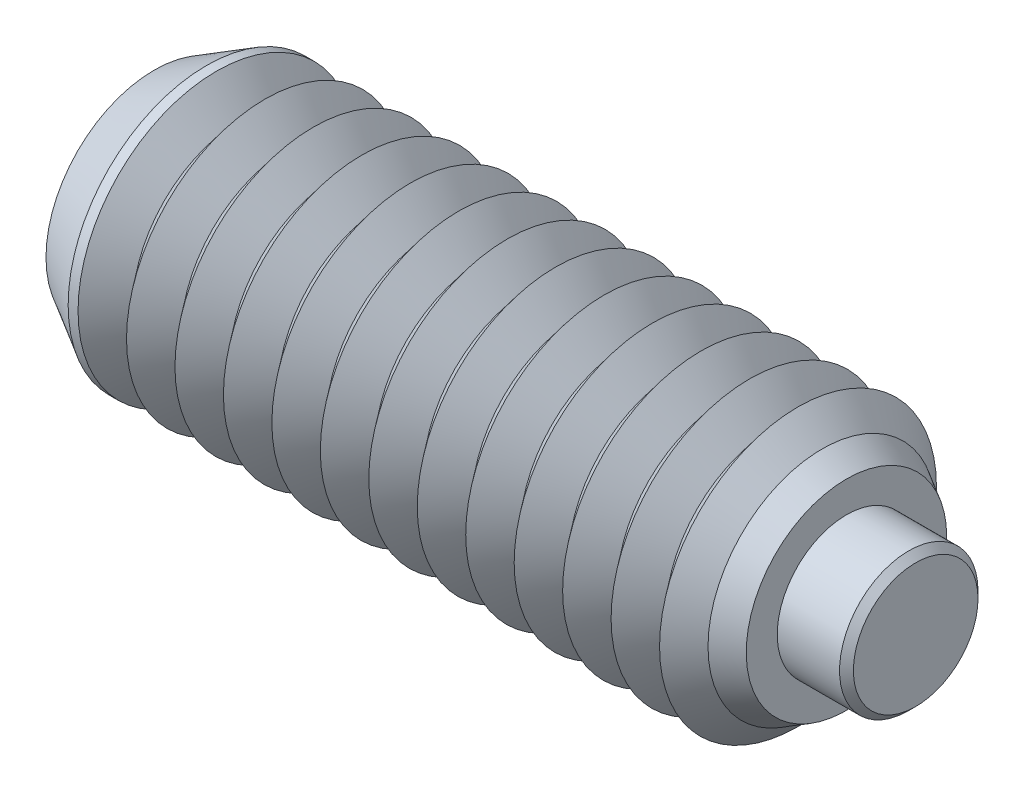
ISO-10303-21;
HEADER;
FILE_DESCRIPTION(('STEP AP214'),'2;1');
FILE_NAME('part.step','',(''),(''),'','','');
FILE_SCHEMA(('AUTOMOTIVE_DESIGN { 1 0 10303 214 1 1 1 1 }'));
ENDSEC;
DATA;
#1=APPLICATION_CONTEXT('core data for automotive mechanical design processes');
#2=APPLICATION_PROTOCOL_DEFINITION('international standard','automotive_design',2000,#1);
#3=PRODUCT_CONTEXT('',#1,'mechanical');
#4=PRODUCT('Part','Part','',(#3));
#5=PRODUCT_RELATED_PRODUCT_CATEGORY('part','',(#4));
#6=PRODUCT_DEFINITION_FORMATION('','',#4);
#7=PRODUCT_DEFINITION_CONTEXT('part definition',#1,'design');
#8=PRODUCT_DEFINITION('design','',#6,#7);
#9=PRODUCT_DEFINITION_SHAPE('','',#8);
#10=(LENGTH_UNIT() NAMED_UNIT(*) SI_UNIT(.MILLI.,.METRE.));
#11=(NAMED_UNIT(*) PLANE_ANGLE_UNIT() SI_UNIT($,.RADIAN.));
#12=(NAMED_UNIT(*) SI_UNIT($,.STERADIAN.) SOLID_ANGLE_UNIT());
#13=UNCERTAINTY_MEASURE_WITH_UNIT(LENGTH_MEASURE(1.E-05),#10,'distance_accuracy_value','');
#14=(GEOMETRIC_REPRESENTATION_CONTEXT(3) GLOBAL_UNCERTAINTY_ASSIGNED_CONTEXT((#13)) GLOBAL_UNIT_ASSIGNED_CONTEXT((#10,
#11,#12)) REPRESENTATION_CONTEXT('',''));
#15=CARTESIAN_POINT('',(0.,0.,0.));
#16=DIRECTION('',(0.,0.,1.));
#17=DIRECTION('',(1.,0.,0.));
#18=AXIS2_PLACEMENT_3D('',#15,#16,#17);
#19=CARTESIAN_POINT('',(1.35,0.,0.));
#20=DIRECTION('',(-1.,0.,0.));
#21=DIRECTION('',(0.,0.,1.));
#22=AXIS2_PLACEMENT_3D('',#19,#20,#21);
#23=CYLINDRICAL_SURFACE('',#22,1.);
#24=CARTESIAN_POINT('',(1.25,0.,0.));
#25=DIRECTION('',(1.,0.,0.));
#26=DIRECTION('',(0.,0.,-1.));
#27=AXIS2_PLACEMENT_3D('',#24,#25,#26);
#28=CIRCLE('',#27,1.);
#29=CARTESIAN_POINT('',(1.25,0.,-1.));
#30=VERTEX_POINT('',#29);
#31=EDGE_CURVE('P0_E10',#30,#30,#28,.F.);
#32=ORIENTED_EDGE('',*,*,#31,.T.);
#33=EDGE_LOOP('',(#32));
#34=FACE_BOUND('',#33,.T.);
#35=CARTESIAN_POINT('',(-0.65,0.,0.));
#36=DIRECTION('',(1.,0.,0.));
#37=DIRECTION('',(0.,0.,-1.));
#38=AXIS2_PLACEMENT_3D('',#35,#36,#37);
#39=CIRCLE('',#38,1.);
#40=CARTESIAN_POINT('',(-0.65,0.,-1.));
#41=VERTEX_POINT('',#40);
#42=EDGE_CURVE('P0_E25',#41,#41,#39,.T.);
#43=ORIENTED_EDGE('',*,*,#42,.T.);
#44=EDGE_LOOP('',(#43));
#45=FACE_BOUND('',#44,.T.);
#46=ADVANCED_FACE('P0_F14',(#34,#45),#23,.T.);
#47=CARTESIAN_POINT('',(1.35,0.,0.));
#48=DIRECTION('',(1.,0.,0.));
#49=DIRECTION('',(0.,0.,-1.));
#50=AXIS2_PLACEMENT_3D('',#47,#48,#49);
#51=PLANE('',#50);
#52=CARTESIAN_POINT('',(1.35,0.,0.));
#53=DIRECTION('',(1.,0.,0.));
#54=DIRECTION('',(0.,0.,-1.));
#55=AXIS2_PLACEMENT_3D('',#52,#53,#54);
#56=CIRCLE('',#55,0.899999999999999);
#57=CARTESIAN_POINT('',(1.35,0.,-0.899999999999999));
#58=VERTEX_POINT('',#57);
#59=EDGE_CURVE('P0_E21',#58,#58,#56,.T.);
#60=ORIENTED_EDGE('',*,*,#59,.T.);
#61=EDGE_LOOP('',(#60));
#62=FACE_BOUND('',#61,.T.);
#63=ADVANCED_FACE('P0_F35',(#62),#51,.T.);
#64=CARTESIAN_POINT('',(-0.65,0.,0.));
#65=DIRECTION('',(1.,0.,0.));
#66=DIRECTION('',(0.,0.,-1.));
#67=AXIS2_PLACEMENT_3D('',#64,#65,#66);
#68=PLANE('',#67);
#69=ORIENTED_EDGE('',*,*,#42,.F.);
#70=EDGE_LOOP('',(#69));
#71=FACE_BOUND('',#70,.T.);
#72=ADVANCED_FACE('P0_F33',(#71),#68,.F.);
#73=CARTESIAN_POINT('',(1.35,0.,0.));
#74=DIRECTION('',(-1.,0.,0.));
#75=DIRECTION('',(0.,0.,1.));
#76=AXIS2_PLACEMENT_3D('',#73,#74,#75);
#77=CONICAL_SURFACE('',#76,0.899999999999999,0.785398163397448);
#78=ORIENTED_EDGE('',*,*,#31,.F.);
#79=EDGE_LOOP('',(#78));
#80=FACE_BOUND('',#79,.T.);
#81=ORIENTED_EDGE('',*,*,#59,.F.);
#82=EDGE_LOOP('',(#81));
#83=FACE_BOUND('',#82,.T.);
#84=ADVANCED_FACE('P0_F16',(#80,#83),#77,.T.);
#85=CLOSED_SHELL('',(#46,#63,#72,#84));
#86=MANIFOLD_SOLID_BREP('P0_B1',#85);
#87=CARTESIAN_POINT('',(-9.65,0.,0.));
#88=DIRECTION('',(1.,0.,0.));
#89=DIRECTION('',(0.,0.,-1.));
#90=AXIS2_PLACEMENT_3D('',#87,#88,#89);
#91=CYLINDRICAL_SURFACE('',#90,2.);
#92=CARTESIAN_POINT('',(-8.75,0.,0.));
#93=DIRECTION('',(1.,0.,0.));
#94=DIRECTION('',(0.,0.,-1.));
#95=AXIS2_PLACEMENT_3D('',#92,#93,#94);
#96=CIRCLE('',#95,2.);
#97=CARTESIAN_POINT('',(-8.75,0.,-2.));
#98=VERTEX_POINT('',#97);
#99=EDGE_CURVE('P1_E226',#98,#98,#96,.T.);
#100=ORIENTED_EDGE('',*,*,#99,.F.);
#101=EDGE_LOOP('',(#100));
#102=FACE_BOUND('',#101,.T.);
#103=CARTESIAN_POINT('',(-8.89283423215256,0.,0.));
#104=DIRECTION('',(1.,0.,0.));
#105=DIRECTION('',(0.,0.,-1.));
#106=AXIS2_PLACEMENT_3D('',#103,#104,#105);
#107=CIRCLE('',#106,2.);
#108=CARTESIAN_POINT('',(-8.89283423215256,0.,-2.));
#109=VERTEX_POINT('',#108);
#110=EDGE_CURVE('P1_E229',#109,#109,#107,.T.);
#111=ORIENTED_EDGE('',*,*,#110,.T.);
#112=EDGE_LOOP('',(#111));
#113=FACE_BOUND('',#112,.T.);
#114=ADVANCED_FACE('P1_F15',(#102,#113),#91,.T.);
#115=CARTESIAN_POINT('',(-0.700000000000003,0.,0.));
#116=DIRECTION('',(1.,0.,0.));
#117=DIRECTION('',(0.,0.,-1.));
#118=AXIS2_PLACEMENT_3D('',#115,#116,#117);
#119=CONICAL_SURFACE('',#118,1.56285014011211,0.895664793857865);
#120=CARTESIAN_POINT('',(-0.350000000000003,0.,0.));
#121=DIRECTION('',(1.,0.,0.));
#122=DIRECTION('',(0.,0.,-1.));
#123=AXIS2_PLACEMENT_3D('',#120,#121,#122);
#124=CIRCLE('',#123,2.);
#125=CARTESIAN_POINT('',(-0.350000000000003,0.,-2.));
#126=VERTEX_POINT('',#125);
#127=EDGE_CURVE('P1_E284',#126,#126,#124,.T.);
#128=ORIENTED_EDGE('',*,*,#127,.F.);
#129=EDGE_LOOP('',(#128));
#130=FACE_BOUND('',#129,.T.);
#131=CARTESIAN_POINT('',(-0.700000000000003,0.,0.));
#132=DIRECTION('',(1.,0.,0.));
#133=DIRECTION('',(0.,0.,-1.));
#134=AXIS2_PLACEMENT_3D('',#131,#132,#133);
#135=CIRCLE('',#134,1.56285014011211);
#136=CARTESIAN_POINT('',(-0.700000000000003,0.,-1.56285014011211));
#137=VERTEX_POINT('',#136);
#138=EDGE_CURVE('P1_E289',#137,#137,#135,.T.);
#139=ORIENTED_EDGE('',*,*,#138,.T.);
#140=EDGE_LOOP('',(#139));
#141=FACE_BOUND('',#140,.T.);
#142=ADVANCED_FACE('P1_F214',(#130,#141),#119,.T.);
#143=CARTESIAN_POINT('',(-1.05,0.,0.));
#144=DIRECTION('',(-1.,0.,0.));
#145=DIRECTION('',(0.,0.,1.));
#146=AXIS2_PLACEMENT_3D('',#143,#144,#145);
#147=CONICAL_SURFACE('',#146,2.,0.895664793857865);
#148=ORIENTED_EDGE('',*,*,#138,.F.);
#149=EDGE_LOOP('',(#148));
#150=FACE_BOUND('',#149,.T.);
#151=CARTESIAN_POINT('',(-1.05,0.,0.));
#152=DIRECTION('',(1.,0.,0.));
#153=DIRECTION('',(0.,0.,-1.));
#154=AXIS2_PLACEMENT_3D('',#151,#152,#153);
#155=CIRCLE('',#154,2.);
#156=CARTESIAN_POINT('',(-1.05,0.,-2.));
#157=VERTEX_POINT('',#156);
#158=EDGE_CURVE('P1_E292',#157,#157,#155,.T.);
#159=ORIENTED_EDGE('',*,*,#158,.T.);
#160=EDGE_LOOP('',(#159));
#161=FACE_BOUND('',#160,.T.);
#162=ADVANCED_FACE('P1_F220',(#150,#161),#147,.T.);
#163=CARTESIAN_POINT('',(-0.65,0.,0.));
#164=DIRECTION('',(1.,0.,0.));
#165=DIRECTION('',(0.,1.,0.));
#166=AXIS2_PLACEMENT_3D('',#163,#164,#165);
#167=PLANE('',#166);
#168=CARTESIAN_POINT('',(-0.65,0.,0.));
#169=DIRECTION('',(1.,0.,0.));
#170=DIRECTION('',(0.,1.,0.));
#171=AXIS2_PLACEMENT_3D('',#168,#169,#170);
#172=CIRCLE('',#171,1.);
#173=CARTESIAN_POINT('',(-0.65,1.,0.));
#174=VERTEX_POINT('',#173);
#175=EDGE_CURVE('P1_E279',#174,#174,#172,.T.);
#176=ORIENTED_EDGE('',*,*,#175,.T.);
#177=EDGE_LOOP('',(#176));
#178=FACE_BOUND('',#177,.T.);
#179=ADVANCED_FACE('P1_F451',(#178),#167,.T.);
#180=CARTESIAN_POINT('',(-0.65,0.,0.));
#181=DIRECTION('',(1.,0.,0.));
#182=DIRECTION('',(0.,1.,0.));
#183=AXIS2_PLACEMENT_3D('',#180,#181,#182);
#184=CYLINDRICAL_SURFACE('',#183,1.);
#185=ORIENTED_EDGE('',*,*,#175,.F.);
#186=EDGE_LOOP('',(#185));
#187=FACE_BOUND('',#186,.T.);
#188=CARTESIAN_POINT('',(0.35,0.,0.));
#189=DIRECTION('',(1.,0.,0.));
#190=DIRECTION('',(0.,1.,0.));
#191=AXIS2_PLACEMENT_3D('',#188,#189,#190);
#192=CIRCLE('',#191,1.);
#193=CARTESIAN_POINT('',(0.35,1.,0.));
#194=VERTEX_POINT('',#193);
#195=EDGE_CURVE('P1_E281',#194,#194,#192,.T.);
#196=ORIENTED_EDGE('',*,*,#195,.T.);
#197=EDGE_LOOP('',(#196));
#198=FACE_BOUND('',#197,.T.);
#199=ADVANCED_FACE('P1_F210',(#187,#198),#184,.F.);
#200=CARTESIAN_POINT('',(0.35,1.44792740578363,0.));
#201=DIRECTION('',(1.,0.,0.));
#202=DIRECTION('',(0.,1.,0.));
#203=AXIS2_PLACEMENT_3D('',#200,#201,#202);
#204=PLANE('',#203);
#205=ORIENTED_EDGE('',*,*,#195,.F.);
#206=EDGE_LOOP('',(#205));
#207=FACE_BOUND('',#206,.T.);
#208=CARTESIAN_POINT('',(0.35,0.,0.));
#209=DIRECTION('',(1.,0.,0.));
#210=DIRECTION('',(0.,1.,0.));
#211=AXIS2_PLACEMENT_3D('',#208,#209,#210);
#212=CIRCLE('',#211,1.44792740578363);
#213=CARTESIAN_POINT('',(0.35,1.44792740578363,0.));
#214=VERTEX_POINT('',#213);
#215=EDGE_CURVE('P1_E121',#214,#214,#212,.T.);
#216=ORIENTED_EDGE('',*,*,#215,.T.);
#217=EDGE_LOOP('',(#216));
#218=FACE_BOUND('',#217,.T.);
#219=ADVANCED_FACE('P1_F206',(#207,#218),#204,.T.);
#220=CARTESIAN_POINT('',(0.35,0.,0.));
#221=DIRECTION('',(-1.,0.,0.));
#222=DIRECTION('',(0.,-1.,0.));
#223=AXIS2_PLACEMENT_3D('',#220,#221,#222);
#224=CONICAL_SURFACE('',#223,1.44792740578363,0.523598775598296);
#225=CARTESIAN_POINT('',(0.,0.,0.));
#226=DIRECTION('',(1.,0.,0.));
#227=DIRECTION('',(0.,0.,-1.));
#228=AXIS2_PLACEMENT_3D('',#225,#226,#227);
#229=CIRCLE('',#228,1.65);
#230=CARTESIAN_POINT('',(0.,0.,-1.65));
#231=VERTEX_POINT('',#230);
#232=EDGE_CURVE('P1_E236',#231,#231,#229,.T.);
#233=ORIENTED_EDGE('',*,*,#232,.T.);
#234=EDGE_LOOP('',(#233));
#235=FACE_BOUND('',#234,.T.);
#236=ORIENTED_EDGE('',*,*,#215,.F.);
#237=EDGE_LOOP('',(#236));
#238=FACE_BOUND('',#237,.T.);
#239=ADVANCED_FACE('P1_F203',(#235,#238),#224,.T.);
#240=CARTESIAN_POINT('',(0.,0.,0.));
#241=DIRECTION('',(-1.,0.,0.));
#242=DIRECTION('',(0.,0.,1.));
#243=AXIS2_PLACEMENT_3D('',#240,#241,#242);
#244=CONICAL_SURFACE('',#243,1.65,0.785398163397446);
#245=ORIENTED_EDGE('',*,*,#127,.T.);
#246=EDGE_LOOP('',(#245));
#247=FACE_BOUND('',#246,.T.);
#248=ORIENTED_EDGE('',*,*,#232,.F.);
#249=EDGE_LOOP('',(#248));
#250=FACE_BOUND('',#249,.T.);
#251=ADVANCED_FACE('P1_F17',(#247,#250),#244,.T.);
#252=CARTESIAN_POINT('',(-1.4,0.,0.));
#253=DIRECTION('',(1.,0.,0.));
#254=DIRECTION('',(0.,0.,-1.));
#255=AXIS2_PLACEMENT_3D('',#252,#253,#254);
#256=CONICAL_SURFACE('',#255,1.56285014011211,0.895664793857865);
#257=ORIENTED_EDGE('',*,*,#158,.F.);
#258=EDGE_LOOP('',(#257));
#259=FACE_BOUND('',#258,.T.);
#260=CARTESIAN_POINT('',(-1.4,0.,0.));
#261=DIRECTION('',(1.,0.,0.));
#262=DIRECTION('',(0.,0.,-1.));
#263=AXIS2_PLACEMENT_3D('',#260,#261,#262);
#264=CIRCLE('',#263,1.56285014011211);
#265=CARTESIAN_POINT('',(-1.4,0.,-1.56285014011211));
#266=VERTEX_POINT('',#265);
#267=EDGE_CURVE('P1_E295',#266,#266,#264,.T.);
#268=ORIENTED_EDGE('',*,*,#267,.T.);
#269=EDGE_LOOP('',(#268));
#270=FACE_BOUND('',#269,.T.);
#271=ADVANCED_FACE('P1_F445',(#259,#270),#256,.T.);
#272=CARTESIAN_POINT('',(-1.75,0.,0.));
#273=DIRECTION('',(-1.,0.,0.));
#274=DIRECTION('',(0.,0.,1.));
#275=AXIS2_PLACEMENT_3D('',#272,#273,#274);
#276=CONICAL_SURFACE('',#275,2.,0.895664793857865);
#277=ORIENTED_EDGE('',*,*,#267,.F.);
#278=EDGE_LOOP('',(#277));
#279=FACE_BOUND('',#278,.T.);
#280=CARTESIAN_POINT('',(-1.75,0.,0.));
#281=DIRECTION('',(1.,0.,0.));
#282=DIRECTION('',(0.,0.,-1.));
#283=AXIS2_PLACEMENT_3D('',#280,#281,#282);
#284=CIRCLE('',#283,2.);
#285=CARTESIAN_POINT('',(-1.75,0.,-2.));
#286=VERTEX_POINT('',#285);
#287=EDGE_CURVE('P1_E298',#286,#286,#284,.T.);
#288=ORIENTED_EDGE('',*,*,#287,.T.);
#289=EDGE_LOOP('',(#288));
#290=FACE_BOUND('',#289,.T.);
#291=ADVANCED_FACE('P1_F441',(#279,#290),#276,.T.);
#292=CARTESIAN_POINT('',(-2.1,0.,0.));
#293=DIRECTION('',(1.,0.,0.));
#294=DIRECTION('',(0.,0.,-1.));
#295=AXIS2_PLACEMENT_3D('',#292,#293,#294);
#296=CONICAL_SURFACE('',#295,1.56285014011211,0.895664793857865);
#297=ORIENTED_EDGE('',*,*,#287,.F.);
#298=EDGE_LOOP('',(#297));
#299=FACE_BOUND('',#298,.T.);
#300=CARTESIAN_POINT('',(-2.1,0.,0.));
#301=DIRECTION('',(1.,0.,0.));
#302=DIRECTION('',(0.,0.,-1.));
#303=AXIS2_PLACEMENT_3D('',#300,#301,#302);
#304=CIRCLE('',#303,1.56285014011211);
#305=CARTESIAN_POINT('',(-2.1,0.,-1.56285014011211));
#306=VERTEX_POINT('',#305);
#307=EDGE_CURVE('P1_E301',#306,#306,#304,.T.);
#308=ORIENTED_EDGE('',*,*,#307,.T.);
#309=EDGE_LOOP('',(#308));
#310=FACE_BOUND('',#309,.T.);
#311=ADVANCED_FACE('P1_F437',(#299,#310),#296,.T.);
#312=CARTESIAN_POINT('',(-2.45,0.,0.));
#313=DIRECTION('',(-1.,0.,0.));
#314=DIRECTION('',(0.,0.,1.));
#315=AXIS2_PLACEMENT_3D('',#312,#313,#314);
#316=CONICAL_SURFACE('',#315,2.,0.895664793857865);
#317=ORIENTED_EDGE('',*,*,#307,.F.);
#318=EDGE_LOOP('',(#317));
#319=FACE_BOUND('',#318,.T.);
#320=CARTESIAN_POINT('',(-2.45,0.,0.));
#321=DIRECTION('',(1.,0.,0.));
#322=DIRECTION('',(0.,0.,-1.));
#323=AXIS2_PLACEMENT_3D('',#320,#321,#322);
#324=CIRCLE('',#323,2.);
#325=CARTESIAN_POINT('',(-2.45,0.,-2.));
#326=VERTEX_POINT('',#325);
#327=EDGE_CURVE('P1_E304',#326,#326,#324,.T.);
#328=ORIENTED_EDGE('',*,*,#327,.T.);
#329=EDGE_LOOP('',(#328));
#330=FACE_BOUND('',#329,.T.);
#331=ADVANCED_FACE('P1_F433',(#319,#330),#316,.T.);
#332=CARTESIAN_POINT('',(-2.8,0.,0.));
#333=DIRECTION('',(1.,0.,0.));
#334=DIRECTION('',(0.,0.,-1.));
#335=AXIS2_PLACEMENT_3D('',#332,#333,#334);
#336=CONICAL_SURFACE('',#335,1.56285014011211,0.895664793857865);
#337=ORIENTED_EDGE('',*,*,#327,.F.);
#338=EDGE_LOOP('',(#337));
#339=FACE_BOUND('',#338,.T.);
#340=CARTESIAN_POINT('',(-2.8,0.,0.));
#341=DIRECTION('',(1.,0.,0.));
#342=DIRECTION('',(0.,0.,-1.));
#343=AXIS2_PLACEMENT_3D('',#340,#341,#342);
#344=CIRCLE('',#343,1.56285014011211);
#345=CARTESIAN_POINT('',(-2.8,0.,-1.56285014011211));
#346=VERTEX_POINT('',#345);
#347=EDGE_CURVE('P1_E307',#346,#346,#344,.T.);
#348=ORIENTED_EDGE('',*,*,#347,.T.);
#349=EDGE_LOOP('',(#348));
#350=FACE_BOUND('',#349,.T.);
#351=ADVANCED_FACE('P1_F429',(#339,#350),#336,.T.);
#352=CARTESIAN_POINT('',(-3.15,0.,0.));
#353=DIRECTION('',(-1.,0.,0.));
#354=DIRECTION('',(0.,0.,1.));
#355=AXIS2_PLACEMENT_3D('',#352,#353,#354);
#356=CONICAL_SURFACE('',#355,2.,0.895664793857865);
#357=ORIENTED_EDGE('',*,*,#347,.F.);
#358=EDGE_LOOP('',(#357));
#359=FACE_BOUND('',#358,.T.);
#360=CARTESIAN_POINT('',(-3.15,0.,0.));
#361=DIRECTION('',(1.,0.,0.));
#362=DIRECTION('',(0.,0.,-1.));
#363=AXIS2_PLACEMENT_3D('',#360,#361,#362);
#364=CIRCLE('',#363,2.);
#365=CARTESIAN_POINT('',(-3.15,0.,-2.));
#366=VERTEX_POINT('',#365);
#367=EDGE_CURVE('P1_E310',#366,#366,#364,.T.);
#368=ORIENTED_EDGE('',*,*,#367,.T.);
#369=EDGE_LOOP('',(#368));
#370=FACE_BOUND('',#369,.T.);
#371=ADVANCED_FACE('P1_F425',(#359,#370),#356,.T.);
#372=CARTESIAN_POINT('',(-3.5,0.,0.));
#373=DIRECTION('',(1.,0.,0.));
#374=DIRECTION('',(0.,0.,-1.));
#375=AXIS2_PLACEMENT_3D('',#372,#373,#374);
#376=CONICAL_SURFACE('',#375,1.56285014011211,0.895664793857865);
#377=ORIENTED_EDGE('',*,*,#367,.F.);
#378=EDGE_LOOP('',(#377));
#379=FACE_BOUND('',#378,.T.);
#380=CARTESIAN_POINT('',(-3.5,0.,0.));
#381=DIRECTION('',(1.,0.,0.));
#382=DIRECTION('',(0.,0.,-1.));
#383=AXIS2_PLACEMENT_3D('',#380,#381,#382);
#384=CIRCLE('',#383,1.56285014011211);
#385=CARTESIAN_POINT('',(-3.5,0.,-1.56285014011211));
#386=VERTEX_POINT('',#385);
#387=EDGE_CURVE('P1_E313',#386,#386,#384,.T.);
#388=ORIENTED_EDGE('',*,*,#387,.T.);
#389=EDGE_LOOP('',(#388));
#390=FACE_BOUND('',#389,.T.);
#391=ADVANCED_FACE('P1_F421',(#379,#390),#376,.T.);
#392=CARTESIAN_POINT('',(-3.85,0.,0.));
#393=DIRECTION('',(-1.,0.,0.));
#394=DIRECTION('',(0.,0.,1.));
#395=AXIS2_PLACEMENT_3D('',#392,#393,#394);
#396=CONICAL_SURFACE('',#395,2.,0.895664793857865);
#397=ORIENTED_EDGE('',*,*,#387,.F.);
#398=EDGE_LOOP('',(#397));
#399=FACE_BOUND('',#398,.T.);
#400=CARTESIAN_POINT('',(-3.85,0.,0.));
#401=DIRECTION('',(1.,0.,0.));
#402=DIRECTION('',(0.,0.,-1.));
#403=AXIS2_PLACEMENT_3D('',#400,#401,#402);
#404=CIRCLE('',#403,2.);
#405=CARTESIAN_POINT('',(-3.85,0.,-2.));
#406=VERTEX_POINT('',#405);
#407=EDGE_CURVE('P1_E316',#406,#406,#404,.T.);
#408=ORIENTED_EDGE('',*,*,#407,.T.);
#409=EDGE_LOOP('',(#408));
#410=FACE_BOUND('',#409,.T.);
#411=ADVANCED_FACE('P1_F417',(#399,#410),#396,.T.);
#412=CARTESIAN_POINT('',(-4.2,0.,0.));
#413=DIRECTION('',(1.,0.,0.));
#414=DIRECTION('',(0.,0.,-1.));
#415=AXIS2_PLACEMENT_3D('',#412,#413,#414);
#416=CONICAL_SURFACE('',#415,1.56285014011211,0.895664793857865);
#417=ORIENTED_EDGE('',*,*,#407,.F.);
#418=EDGE_LOOP('',(#417));
#419=FACE_BOUND('',#418,.T.);
#420=CARTESIAN_POINT('',(-4.2,0.,0.));
#421=DIRECTION('',(1.,0.,0.));
#422=DIRECTION('',(0.,0.,-1.));
#423=AXIS2_PLACEMENT_3D('',#420,#421,#422);
#424=CIRCLE('',#423,1.56285014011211);
#425=CARTESIAN_POINT('',(-4.2,0.,-1.56285014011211));
#426=VERTEX_POINT('',#425);
#427=EDGE_CURVE('P1_E319',#426,#426,#424,.T.);
#428=ORIENTED_EDGE('',*,*,#427,.T.);
#429=EDGE_LOOP('',(#428));
#430=FACE_BOUND('',#429,.T.);
#431=ADVANCED_FACE('P1_F413',(#419,#430),#416,.T.);
#432=CARTESIAN_POINT('',(-4.55,0.,0.));
#433=DIRECTION('',(-1.,0.,0.));
#434=DIRECTION('',(0.,0.,1.));
#435=AXIS2_PLACEMENT_3D('',#432,#433,#434);
#436=CONICAL_SURFACE('',#435,2.,0.895664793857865);
#437=ORIENTED_EDGE('',*,*,#427,.F.);
#438=EDGE_LOOP('',(#437));
#439=FACE_BOUND('',#438,.T.);
#440=CARTESIAN_POINT('',(-4.55,0.,0.));
#441=DIRECTION('',(1.,0.,0.));
#442=DIRECTION('',(0.,0.,-1.));
#443=AXIS2_PLACEMENT_3D('',#440,#441,#442);
#444=CIRCLE('',#443,2.);
#445=CARTESIAN_POINT('',(-4.55,0.,-2.));
#446=VERTEX_POINT('',#445);
#447=EDGE_CURVE('P1_E322',#446,#446,#444,.T.);
#448=ORIENTED_EDGE('',*,*,#447,.T.);
#449=EDGE_LOOP('',(#448));
#450=FACE_BOUND('',#449,.T.);
#451=ADVANCED_FACE('P1_F409',(#439,#450),#436,.T.);
#452=CARTESIAN_POINT('',(-4.9,0.,0.));
#453=DIRECTION('',(1.,0.,0.));
#454=DIRECTION('',(0.,0.,-1.));
#455=AXIS2_PLACEMENT_3D('',#452,#453,#454);
#456=CONICAL_SURFACE('',#455,1.56285014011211,0.895664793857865);
#457=ORIENTED_EDGE('',*,*,#447,.F.);
#458=EDGE_LOOP('',(#457));
#459=FACE_BOUND('',#458,.T.);
#460=CARTESIAN_POINT('',(-4.9,0.,0.));
#461=DIRECTION('',(1.,0.,0.));
#462=DIRECTION('',(0.,0.,-1.));
#463=AXIS2_PLACEMENT_3D('',#460,#461,#462);
#464=CIRCLE('',#463,1.56285014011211);
#465=CARTESIAN_POINT('',(-4.9,0.,-1.56285014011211));
#466=VERTEX_POINT('',#465);
#467=EDGE_CURVE('P1_E325',#466,#466,#464,.T.);
#468=ORIENTED_EDGE('',*,*,#467,.T.);
#469=EDGE_LOOP('',(#468));
#470=FACE_BOUND('',#469,.T.);
#471=ADVANCED_FACE('P1_F405',(#459,#470),#456,.T.);
#472=CARTESIAN_POINT('',(-5.25,0.,0.));
#473=DIRECTION('',(-1.,0.,0.));
#474=DIRECTION('',(0.,0.,1.));
#475=AXIS2_PLACEMENT_3D('',#472,#473,#474);
#476=CONICAL_SURFACE('',#475,2.,0.895664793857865);
#477=ORIENTED_EDGE('',*,*,#467,.F.);
#478=EDGE_LOOP('',(#477));
#479=FACE_BOUND('',#478,.T.);
#480=CARTESIAN_POINT('',(-5.25,0.,0.));
#481=DIRECTION('',(1.,0.,0.));
#482=DIRECTION('',(0.,0.,-1.));
#483=AXIS2_PLACEMENT_3D('',#480,#481,#482);
#484=CIRCLE('',#483,2.);
#485=CARTESIAN_POINT('',(-5.25,0.,-2.));
#486=VERTEX_POINT('',#485);
#487=EDGE_CURVE('P1_E328',#486,#486,#484,.T.);
#488=ORIENTED_EDGE('',*,*,#487,.T.);
#489=EDGE_LOOP('',(#488));
#490=FACE_BOUND('',#489,.T.);
#491=ADVANCED_FACE('P1_F401',(#479,#490),#476,.T.);
#492=CARTESIAN_POINT('',(-5.6,0.,0.));
#493=DIRECTION('',(1.,0.,0.));
#494=DIRECTION('',(0.,0.,-1.));
#495=AXIS2_PLACEMENT_3D('',#492,#493,#494);
#496=CONICAL_SURFACE('',#495,1.56285014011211,0.895664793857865);
#497=ORIENTED_EDGE('',*,*,#487,.F.);
#498=EDGE_LOOP('',(#497));
#499=FACE_BOUND('',#498,.T.);
#500=CARTESIAN_POINT('',(-5.6,0.,0.));
#501=DIRECTION('',(1.,0.,0.));
#502=DIRECTION('',(0.,0.,-1.));
#503=AXIS2_PLACEMENT_3D('',#500,#501,#502);
#504=CIRCLE('',#503,1.56285014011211);
#505=CARTESIAN_POINT('',(-5.6,0.,-1.56285014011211));
#506=VERTEX_POINT('',#505);
#507=EDGE_CURVE('P1_E331',#506,#506,#504,.T.);
#508=ORIENTED_EDGE('',*,*,#507,.T.);
#509=EDGE_LOOP('',(#508));
#510=FACE_BOUND('',#509,.T.);
#511=ADVANCED_FACE('P1_F397',(#499,#510),#496,.T.);
#512=CARTESIAN_POINT('',(-5.95,0.,0.));
#513=DIRECTION('',(-1.,0.,0.));
#514=DIRECTION('',(0.,0.,1.));
#515=AXIS2_PLACEMENT_3D('',#512,#513,#514);
#516=CONICAL_SURFACE('',#515,2.,0.895664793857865);
#517=ORIENTED_EDGE('',*,*,#507,.F.);
#518=EDGE_LOOP('',(#517));
#519=FACE_BOUND('',#518,.T.);
#520=CARTESIAN_POINT('',(-5.95,0.,0.));
#521=DIRECTION('',(1.,0.,0.));
#522=DIRECTION('',(0.,0.,-1.));
#523=AXIS2_PLACEMENT_3D('',#520,#521,#522);
#524=CIRCLE('',#523,2.);
#525=CARTESIAN_POINT('',(-5.95,0.,-2.));
#526=VERTEX_POINT('',#525);
#527=EDGE_CURVE('P1_E334',#526,#526,#524,.T.);
#528=ORIENTED_EDGE('',*,*,#527,.T.);
#529=EDGE_LOOP('',(#528));
#530=FACE_BOUND('',#529,.T.);
#531=ADVANCED_FACE('P1_F393',(#519,#530),#516,.T.);
#532=CARTESIAN_POINT('',(-6.3,0.,0.));
#533=DIRECTION('',(1.,0.,0.));
#534=DIRECTION('',(0.,0.,-1.));
#535=AXIS2_PLACEMENT_3D('',#532,#533,#534);
#536=CONICAL_SURFACE('',#535,1.56285014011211,0.895664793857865);
#537=ORIENTED_EDGE('',*,*,#527,.F.);
#538=EDGE_LOOP('',(#537));
#539=FACE_BOUND('',#538,.T.);
#540=CARTESIAN_POINT('',(-6.3,0.,0.));
#541=DIRECTION('',(1.,0.,0.));
#542=DIRECTION('',(0.,0.,-1.));
#543=AXIS2_PLACEMENT_3D('',#540,#541,#542);
#544=CIRCLE('',#543,1.56285014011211);
#545=CARTESIAN_POINT('',(-6.3,0.,-1.56285014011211));
#546=VERTEX_POINT('',#545);
#547=EDGE_CURVE('P1_E337',#546,#546,#544,.T.);
#548=ORIENTED_EDGE('',*,*,#547,.T.);
#549=EDGE_LOOP('',(#548));
#550=FACE_BOUND('',#549,.T.);
#551=ADVANCED_FACE('P1_F389',(#539,#550),#536,.T.);
#552=CARTESIAN_POINT('',(-6.65,0.,0.));
#553=DIRECTION('',(-1.,0.,0.));
#554=DIRECTION('',(0.,0.,1.));
#555=AXIS2_PLACEMENT_3D('',#552,#553,#554);
#556=CONICAL_SURFACE('',#555,2.,0.895664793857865);
#557=ORIENTED_EDGE('',*,*,#547,.F.);
#558=EDGE_LOOP('',(#557));
#559=FACE_BOUND('',#558,.T.);
#560=CARTESIAN_POINT('',(-6.65,0.,0.));
#561=DIRECTION('',(1.,0.,0.));
#562=DIRECTION('',(0.,0.,-1.));
#563=AXIS2_PLACEMENT_3D('',#560,#561,#562);
#564=CIRCLE('',#563,2.);
#565=CARTESIAN_POINT('',(-6.65,0.,-2.));
#566=VERTEX_POINT('',#565);
#567=EDGE_CURVE('P1_E340',#566,#566,#564,.T.);
#568=ORIENTED_EDGE('',*,*,#567,.T.);
#569=EDGE_LOOP('',(#568));
#570=FACE_BOUND('',#569,.T.);
#571=ADVANCED_FACE('P1_F385',(#559,#570),#556,.T.);
#572=CARTESIAN_POINT('',(-7.,0.,0.));
#573=DIRECTION('',(1.,0.,0.));
#574=DIRECTION('',(0.,0.,-1.));
#575=AXIS2_PLACEMENT_3D('',#572,#573,#574);
#576=CONICAL_SURFACE('',#575,1.56285014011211,0.895664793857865);
#577=ORIENTED_EDGE('',*,*,#567,.F.);
#578=EDGE_LOOP('',(#577));
#579=FACE_BOUND('',#578,.T.);
#580=CARTESIAN_POINT('',(-7.,0.,0.));
#581=DIRECTION('',(1.,0.,0.));
#582=DIRECTION('',(0.,0.,-1.));
#583=AXIS2_PLACEMENT_3D('',#580,#581,#582);
#584=CIRCLE('',#583,1.56285014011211);
#585=CARTESIAN_POINT('',(-7.,0.,-1.56285014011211));
#586=VERTEX_POINT('',#585);
#587=EDGE_CURVE('P1_E343',#586,#586,#584,.T.);
#588=ORIENTED_EDGE('',*,*,#587,.T.);
#589=EDGE_LOOP('',(#588));
#590=FACE_BOUND('',#589,.T.);
#591=ADVANCED_FACE('P1_F381',(#579,#590),#576,.T.);
#592=CARTESIAN_POINT('',(-7.35,0.,0.));
#593=DIRECTION('',(-1.,0.,0.));
#594=DIRECTION('',(0.,0.,1.));
#595=AXIS2_PLACEMENT_3D('',#592,#593,#594);
#596=CONICAL_SURFACE('',#595,2.,0.895664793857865);
#597=ORIENTED_EDGE('',*,*,#587,.F.);
#598=EDGE_LOOP('',(#597));
#599=FACE_BOUND('',#598,.T.);
#600=CARTESIAN_POINT('',(-7.35,0.,0.));
#601=DIRECTION('',(1.,0.,0.));
#602=DIRECTION('',(0.,0.,-1.));
#603=AXIS2_PLACEMENT_3D('',#600,#601,#602);
#604=CIRCLE('',#603,2.);
#605=CARTESIAN_POINT('',(-7.35,0.,-2.));
#606=VERTEX_POINT('',#605);
#607=EDGE_CURVE('P1_E346',#606,#606,#604,.T.);
#608=ORIENTED_EDGE('',*,*,#607,.T.);
#609=EDGE_LOOP('',(#608));
#610=FACE_BOUND('',#609,.T.);
#611=ADVANCED_FACE('P1_F377',(#599,#610),#596,.T.);
#612=CARTESIAN_POINT('',(-7.7,0.,0.));
#613=DIRECTION('',(1.,0.,0.));
#614=DIRECTION('',(0.,0.,-1.));
#615=AXIS2_PLACEMENT_3D('',#612,#613,#614);
#616=CONICAL_SURFACE('',#615,1.56285014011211,0.895664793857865);
#617=ORIENTED_EDGE('',*,*,#607,.F.);
#618=EDGE_LOOP('',(#617));
#619=FACE_BOUND('',#618,.T.);
#620=CARTESIAN_POINT('',(-7.7,0.,0.));
#621=DIRECTION('',(1.,0.,0.));
#622=DIRECTION('',(0.,0.,-1.));
#623=AXIS2_PLACEMENT_3D('',#620,#621,#622);
#624=CIRCLE('',#623,1.56285014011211);
#625=CARTESIAN_POINT('',(-7.7,0.,-1.56285014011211));
#626=VERTEX_POINT('',#625);
#627=EDGE_CURVE('P1_E349',#626,#626,#624,.T.);
#628=ORIENTED_EDGE('',*,*,#627,.T.);
#629=EDGE_LOOP('',(#628));
#630=FACE_BOUND('',#629,.T.);
#631=ADVANCED_FACE('P1_F373',(#619,#630),#616,.T.);
#632=CARTESIAN_POINT('',(-8.05,0.,0.));
#633=DIRECTION('',(-1.,0.,0.));
#634=DIRECTION('',(0.,0.,1.));
#635=AXIS2_PLACEMENT_3D('',#632,#633,#634);
#636=CONICAL_SURFACE('',#635,2.,0.895664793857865);
#637=ORIENTED_EDGE('',*,*,#627,.F.);
#638=EDGE_LOOP('',(#637));
#639=FACE_BOUND('',#638,.T.);
#640=CARTESIAN_POINT('',(-8.05,0.,0.));
#641=DIRECTION('',(1.,0.,0.));
#642=DIRECTION('',(0.,0.,-1.));
#643=AXIS2_PLACEMENT_3D('',#640,#641,#642);
#644=CIRCLE('',#643,2.);
#645=CARTESIAN_POINT('',(-8.05,0.,-2.));
#646=VERTEX_POINT('',#645);
#647=EDGE_CURVE('P1_E352',#646,#646,#644,.T.);
#648=ORIENTED_EDGE('',*,*,#647,.T.);
#649=EDGE_LOOP('',(#648));
#650=FACE_BOUND('',#649,.T.);
#651=ADVANCED_FACE('P1_F367',(#639,#650),#636,.T.);
#652=CARTESIAN_POINT('',(-8.4,0.,0.));
#653=DIRECTION('',(1.,0.,0.));
#654=DIRECTION('',(0.,0.,-1.));
#655=AXIS2_PLACEMENT_3D('',#652,#653,#654);
#656=CONICAL_SURFACE('',#655,1.56285014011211,0.895664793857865);
#657=ORIENTED_EDGE('',*,*,#647,.F.);
#658=EDGE_LOOP('',(#657));
#659=FACE_BOUND('',#658,.T.);
#660=CARTESIAN_POINT('',(-8.4,0.,0.));
#661=DIRECTION('',(1.,0.,0.));
#662=DIRECTION('',(0.,0.,-1.));
#663=AXIS2_PLACEMENT_3D('',#660,#661,#662);
#664=CIRCLE('',#663,1.56285014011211);
#665=CARTESIAN_POINT('',(-8.4,0.,-1.56285014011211));
#666=VERTEX_POINT('',#665);
#667=EDGE_CURVE('P1_E232',#666,#666,#664,.T.);
#668=ORIENTED_EDGE('',*,*,#667,.T.);
#669=EDGE_LOOP('',(#668));
#670=FACE_BOUND('',#669,.T.);
#671=ADVANCED_FACE('P1_F358',(#659,#670),#656,.T.);
#672=CARTESIAN_POINT('',(-8.75,0.,0.));
#673=DIRECTION('',(-1.,0.,0.));
#674=DIRECTION('',(0.,0.,1.));
#675=AXIS2_PLACEMENT_3D('',#672,#673,#674);
#676=CONICAL_SURFACE('',#675,2.,0.895664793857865);
#677=ORIENTED_EDGE('',*,*,#667,.F.);
#678=EDGE_LOOP('',(#677));
#679=FACE_BOUND('',#678,.T.);
#680=ORIENTED_EDGE('',*,*,#99,.T.);
#681=EDGE_LOOP('',(#680));
#682=FACE_BOUND('',#681,.T.);
#683=ADVANCED_FACE('P1_F360',(#679,#682),#676,.T.);
#684=CARTESIAN_POINT('',(-9.65,0.,0.));
#685=DIRECTION('',(1.,0.,0.));
#686=DIRECTION('',(0.,0.,1.));
#687=AXIS2_PLACEMENT_3D('',#684,#685,#686);
#688=CONICAL_SURFACE('',#687,1.56285014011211,0.5235987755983);
#689=ORIENTED_EDGE('',*,*,#110,.F.);
#690=EDGE_LOOP('',(#689));
#691=FACE_BOUND('',#690,.T.);
#692=CARTESIAN_POINT('',(-9.65,0.,0.));
#693=DIRECTION('',(-1.,0.,0.));
#694=DIRECTION('',(0.,0.,1.));
#695=AXIS2_PLACEMENT_3D('',#692,#693,#694);
#696=CIRCLE('',#695,1.56285014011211);
#697=CARTESIAN_POINT('',(-9.65,0.,1.56285014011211));
#698=VERTEX_POINT('',#697);
#699=EDGE_CURVE('P1_E231',#698,#698,#696,.T.);
#700=ORIENTED_EDGE('',*,*,#699,.F.);
#701=EDGE_LOOP('',(#700));
#702=FACE_BOUND('',#701,.T.);
#703=ADVANCED_FACE('P1_F159',(#691,#702),#688,.T.);
#704=CARTESIAN_POINT('',(-9.65,0.,0.));
#705=DIRECTION('',(1.,0.,0.));
#706=DIRECTION('',(0.,0.,-1.));
#707=AXIS2_PLACEMENT_3D('',#704,#705,#706);
#708=PLANE('',#707);
#709=CARTESIAN_POINT('',(-9.65,0.,0.));
#710=DIRECTION('',(1.,0.,0.));
#711=DIRECTION('',(0.,0.,-1.));
#712=AXIS2_PLACEMENT_3D('',#709,#710,#711);
#713=CIRCLE('',#712,1.15470053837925);
#714=CARTESIAN_POINT('',(-9.65,-1.,-0.577350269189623));
#715=VERTEX_POINT('',#714);
#716=CARTESIAN_POINT('',(-9.65,0.,-1.15470053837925));
#717=VERTEX_POINT('',#716);
#718=EDGE_CURVE('P1_E19',#715,#717,#713,.T.);
#719=ORIENTED_EDGE('',*,*,#718,.T.);
#720=CARTESIAN_POINT('',(-9.65,1.,-0.577350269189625));
#721=VERTEX_POINT('',#720);
#722=EDGE_CURVE('P1_E10',#717,#721,#713,.T.);
#723=ORIENTED_EDGE('',*,*,#722,.T.);
#724=CARTESIAN_POINT('',(-9.65,0.999999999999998,0.577350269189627));
#725=VERTEX_POINT('',#724);
#726=EDGE_CURVE('P1_E24',#721,#725,#713,.T.);
#727=ORIENTED_EDGE('',*,*,#726,.T.);
#728=CARTESIAN_POINT('',(-9.65,0.,0.));
#729=DIRECTION('',(-1.,0.,0.));
#730=DIRECTION('',(0.,0.,1.));
#731=AXIS2_PLACEMENT_3D('',#728,#729,#730);
#732=CIRCLE('',#731,1.15470053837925);
#733=CARTESIAN_POINT('',(-9.65,0.,1.15470053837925));
#734=VERTEX_POINT('',#733);
#735=EDGE_CURVE('P1_E92',#734,#725,#732,.T.);
#736=ORIENTED_EDGE('',*,*,#735,.F.);
#737=CARTESIAN_POINT('',(-9.65,-1.,0.577350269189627));
#738=VERTEX_POINT('',#737);
#739=EDGE_CURVE('P1_E101',#734,#738,#713,.T.);
#740=ORIENTED_EDGE('',*,*,#739,.T.);
#741=EDGE_CURVE('P1_E107',#738,#715,#713,.T.);
#742=ORIENTED_EDGE('',*,*,#741,.T.);
#743=EDGE_LOOP('',(#719,#723,#727,#736,#740,#742));
#744=FACE_BOUND('',#743,.T.);
#745=ORIENTED_EDGE('',*,*,#699,.T.);
#746=EDGE_LOOP('',(#745));
#747=FACE_BOUND('',#746,.T.);
#748=ADVANCED_FACE('P1_F108',(#744,#747),#708,.F.);
#749=CARTESIAN_POINT('',(-9.65,0.,0.));
#750=DIRECTION('',(-1.,0.,0.));
#751=DIRECTION('',(0.,0.,1.));
#752=AXIS2_PLACEMENT_3D('',#749,#750,#751);
#753=CONICAL_SURFACE('',#752,1.15470053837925,1.0471975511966);
#754=ORIENTED_EDGE('',*,*,#718,.F.);
#755=CARTESIAN_POINT('',(-9.65006667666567,0.000199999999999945,-1.15481600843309));
#756=CARTESIAN_POINT('',(-9.63540897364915,-0.0437473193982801,-1.12944301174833));
#757=CARTESIAN_POINT('',(-9.6220777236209,-0.0880739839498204,-1.10385100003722));
#758=CARTESIAN_POINT('',(-9.59880650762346,-0.177495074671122,-1.05222370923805));
#759=CARTESIAN_POINT('',(-9.58887477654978,-0.222591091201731,-1.02618751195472));
#760=CARTESIAN_POINT('',(-9.57341269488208,-0.312224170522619,-0.97443782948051));
#761=CARTESIAN_POINT('',(-9.56777946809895,-0.356747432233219,-0.948732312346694));
#762=CARTESIAN_POINT('',(-9.56105128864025,-0.446003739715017,-0.897200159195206));
#763=CARTESIAN_POINT('',(-9.55995076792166,-0.490736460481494,-0.871373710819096));
#764=CARTESIAN_POINT('',(-9.56222505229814,-0.574341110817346,-0.823104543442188));
#765=CARTESIAN_POINT('',(-9.56504143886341,-0.613225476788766,-0.80065464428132));
#766=CARTESIAN_POINT('',(-9.57397245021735,-0.690740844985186,-0.755901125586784));
#767=CARTESIAN_POINT('',(-9.5800901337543,-0.729371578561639,-0.733597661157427));
#768=CARTESIAN_POINT('',(-9.59538572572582,-0.807047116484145,-0.688751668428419));
#769=CARTESIAN_POINT('',(-9.60462855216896,-0.846082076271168,-0.666214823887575));
#770=CARTESIAN_POINT('',(-9.62560684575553,-0.923569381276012,-0.62147750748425));
#771=CARTESIAN_POINT('',(-9.63733737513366,-0.962022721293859,-0.599276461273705));
#772=CARTESIAN_POINT('',(-9.65006667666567,-1.0002,-0.577234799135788));
#773=B_SPLINE_CURVE_WITH_KNOTS('',3,(#755,#756,#757,#758,#759,#760,#761,#762,#763,#764,#765,
#766,#767,#768,#769,#770,#771,#772),.UNSPECIFIED.,.F.,.F.,(4,2,2,2,2,2,2,2,4),(0.,
0.158523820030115,0.317428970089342,0.472400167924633,0.627180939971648,0.762016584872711,
0.896977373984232,1.03493410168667,1.17261952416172),.UNSPECIFIED.);
#774=EDGE_CURVE('P1_E130',#717,#715,#773,.T.);
#775=ORIENTED_EDGE('',*,*,#774,.F.);
#776=EDGE_LOOP('',(#754,#775));
#777=FACE_BOUND('',#776,.T.);
#778=ADVANCED_FACE('P1_F158',(#777),#753,.F.);
#779=ORIENTED_EDGE('',*,*,#741,.F.);
#780=CARTESIAN_POINT('',(-10.0218352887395,-1.,-1.49514512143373));
#781=CARTESIAN_POINT('',(-10.0011150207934,-1.,-1.45196126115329));
#782=CARTESIAN_POINT('',(-9.98061367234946,-1.,-1.40867282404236));
#783=CARTESIAN_POINT('',(-9.9401634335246,-1.,-1.32182947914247));
#784=CARTESIAN_POINT('',(-9.92021464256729,-1.,-1.27827452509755));
#785=CARTESIAN_POINT('',(-9.86114515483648,-1.,-1.14662339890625));
#786=CARTESIAN_POINT('',(-9.82305252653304,-1.,-1.05805724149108));
#787=CARTESIAN_POINT('',(-9.75024582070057,-1.,-0.876833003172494));
#788=CARTESIAN_POINT('',(-9.71564584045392,-1.,-0.784128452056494));
#789=CARTESIAN_POINT('',(-9.65407347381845,-1.,-0.596331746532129));
#790=CARTESIAN_POINT('',(-9.62708128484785,-1.,-0.501246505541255));
#791=CARTESIAN_POINT('',(-9.59577577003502,-1.,-0.356699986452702));
#792=CARTESIAN_POINT('',(-9.58687509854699,-1.,-0.308244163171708));
#793=CARTESIAN_POINT('',(-9.57274243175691,-1.,-0.210788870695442));
#794=CARTESIAN_POINT('',(-9.56751018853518,-1.,-0.161789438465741));
#795=CARTESIAN_POINT('',(-9.56119898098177,-1.,-0.0641060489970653));
#796=CARTESIAN_POINT('',(-9.56007100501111,-1.,-0.0154253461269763));
#797=CARTESIAN_POINT('',(-9.56193297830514,-1.,0.081855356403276));
#798=CARTESIAN_POINT('',(-9.56492318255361,-1.,0.130455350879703));
#799=CARTESIAN_POINT('',(-9.5771183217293,-1.,0.250369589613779));
#800=CARTESIAN_POINT('',(-9.58860856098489,-1.,0.321451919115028));
#801=CARTESIAN_POINT('',(-9.61824031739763,-1.,0.462229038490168));
#802=CARTESIAN_POINT('',(-9.63638985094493,-1.,0.531922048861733));
#803=CARTESIAN_POINT('',(-9.67786972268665,-1.,0.671415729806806));
#804=CARTESIAN_POINT('',(-9.70130716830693,-1.,0.741183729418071));
#805=CARTESIAN_POINT('',(-9.75156448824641,-1.,0.879438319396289));
#806=CARTESIAN_POINT('',(-9.77838317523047,-1.,0.947925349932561));
#807=CARTESIAN_POINT('',(-9.8500539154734,-1.,1.12214515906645));
#808=CARTESIAN_POINT('',(-9.89657230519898,-1.,1.22718574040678));
#809=CARTESIAN_POINT('',(-9.99287692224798,-1.,1.43575968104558));
#810=CARTESIAN_POINT('',(-10.0426639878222,-1.,1.53929264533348));
#811=CARTESIAN_POINT('',(-10.1443364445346,-1.,1.74546702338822));
#812=CARTESIAN_POINT('',(-10.196224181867,-1.,1.84810727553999));
#813=CARTESIAN_POINT('',(-10.3013383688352,-1.,2.05270058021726));
#814=CARTESIAN_POINT('',(-10.3545648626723,-1.,2.15465360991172));
#815=CARTESIAN_POINT('',(-10.4568669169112,-1.,2.34846553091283));
#816=CARTESIAN_POINT('',(-10.505859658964,-1.,2.44036823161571));
#817=CARTESIAN_POINT('',(-10.6044031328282,-1.,2.623877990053));
#818=CARTESIAN_POINT('',(-10.6539538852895,-1.,2.71548503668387));
#819=CARTESIAN_POINT('',(-10.7533471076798,-1.,2.89823865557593));
#820=CARTESIAN_POINT('',(-10.803188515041,-1.,2.98938580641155));
#821=CARTESIAN_POINT('',(-10.9031957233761,-1.,3.17149583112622));
#822=CARTESIAN_POINT('',(-10.9533615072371,-1.,3.26245871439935));
#823=CARTESIAN_POINT('',(-11.003646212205,-1.,3.35335539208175));
#824=B_SPLINE_CURVE_WITH_KNOTS('',3,(#780,#781,#782,#783,#784,#785,#786,#787,#788,#789,#790,
#791,#792,#793,#794,#795,#796,#797,#798,#799,#800,#801,#802,#803,#804,#805,#806,#807,#808,#809,
#810,#811,#812,#813,#814,#815,#816,#817,#818,#819,#820,#821,#822,#823),.UNSPECIFIED.,.F.,.F.,(4,
2,2,2,2,2,2,2,2,2,2,2,2,2,2,2,2,2,2,2,2,4),(0.,0.14369034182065,0.287406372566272,
0.576560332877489,0.873259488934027,1.16917907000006,1.31686338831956,1.46453772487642,
1.61044269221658,1.75635669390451,1.97192533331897,2.18775432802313,2.40842600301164,
2.62902040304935,2.97355048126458,3.31816926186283,3.6631841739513,4.00821049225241,
4.32064609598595,4.63309330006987,4.9447457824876,5.2563819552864),.UNSPECIFIED.);
#825=EDGE_CURVE('P1_E128',#715,#738,#824,.T.);
#826=ORIENTED_EDGE('',*,*,#825,.F.);
#827=EDGE_LOOP('',(#779,#826));
#828=FACE_BOUND('',#827,.T.);
#829=ADVANCED_FACE('P1_F503',(#828),#753,.F.);
#830=ORIENTED_EDGE('',*,*,#739,.F.);
#831=CARTESIAN_POINT('',(-9.65006667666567,-1.0002,0.577234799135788));
#832=CARTESIAN_POINT('',(-9.63540897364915,-0.95625268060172,0.602607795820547));
#833=CARTESIAN_POINT('',(-9.6220777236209,-0.91192601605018,0.628199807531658));
#834=CARTESIAN_POINT('',(-9.59880650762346,-0.822504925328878,0.679827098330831));
#835=CARTESIAN_POINT('',(-9.58887477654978,-0.777408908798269,0.705863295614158));
#836=CARTESIAN_POINT('',(-9.57341269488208,-0.687775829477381,0.757612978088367));
#837=CARTESIAN_POINT('',(-9.56777946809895,-0.64325256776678,0.783318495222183));
#838=CARTESIAN_POINT('',(-9.56105128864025,-0.553996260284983,0.834850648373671));
#839=CARTESIAN_POINT('',(-9.55995076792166,-0.509263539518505,0.860677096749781));
#840=CARTESIAN_POINT('',(-9.56222505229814,-0.425658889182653,0.90894626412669));
#841=CARTESIAN_POINT('',(-9.56504143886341,-0.386774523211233,0.931396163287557));
#842=CARTESIAN_POINT('',(-9.57397245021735,-0.309259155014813,0.976149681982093));
#843=CARTESIAN_POINT('',(-9.5800901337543,-0.270628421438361,0.998453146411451));
#844=CARTESIAN_POINT('',(-9.59538572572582,-0.192952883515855,1.04329913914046));
#845=CARTESIAN_POINT('',(-9.60462855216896,-0.153917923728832,1.0658359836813));
#846=CARTESIAN_POINT('',(-9.62560684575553,-0.0764306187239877,1.11057330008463));
#847=CARTESIAN_POINT('',(-9.63733737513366,-0.0379772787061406,1.13277434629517));
#848=CARTESIAN_POINT('',(-9.65006667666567,0.000200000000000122,1.15481600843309));
#849=B_SPLINE_CURVE_WITH_KNOTS('',3,(#831,#832,#833,#834,#835,#836,#837,#838,#839,#840,#841,
#842,#843,#844,#845,#846,#847,#848),.UNSPECIFIED.,.F.,.F.,(4,2,2,2,2,2,2,2,4),(0.,
0.158523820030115,0.317428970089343,0.472400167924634,0.627180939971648,0.762016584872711,
0.896977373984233,1.03493410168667,1.17261952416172),.UNSPECIFIED.);
#850=EDGE_CURVE('P1_E96',#738,#734,#849,.T.);
#851=ORIENTED_EDGE('',*,*,#850,.F.);
#852=EDGE_LOOP('',(#830,#851));
#853=FACE_BOUND('',#852,.T.);
#854=ADVANCED_FACE('P1_F102',(#853),#753,.F.);
#855=ORIENTED_EDGE('',*,*,#735,.T.);
#856=CARTESIAN_POINT('',(-9.65006667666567,-0.000199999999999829,1.15481600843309));
#857=CARTESIAN_POINT('',(-9.63540897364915,0.0437473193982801,1.12944301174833));
#858=CARTESIAN_POINT('',(-9.6220777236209,0.0880739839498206,1.10385100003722));
#859=CARTESIAN_POINT('',(-9.59880650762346,0.177495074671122,1.05222370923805));
#860=CARTESIAN_POINT('',(-9.58887477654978,0.222591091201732,1.02618751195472));
#861=CARTESIAN_POINT('',(-9.57341269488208,0.312224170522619,0.97443782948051));
#862=CARTESIAN_POINT('',(-9.56777946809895,0.356747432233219,0.948732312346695));
#863=CARTESIAN_POINT('',(-9.56105128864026,0.446003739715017,0.897200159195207));
#864=CARTESIAN_POINT('',(-9.55995076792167,0.490736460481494,0.871373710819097));
#865=CARTESIAN_POINT('',(-9.56222505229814,0.574341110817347,0.823104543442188));
#866=CARTESIAN_POINT('',(-9.56504143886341,0.613225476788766,0.800654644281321));
#867=CARTESIAN_POINT('',(-9.57397245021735,0.690740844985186,0.755901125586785));
#868=CARTESIAN_POINT('',(-9.5800901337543,0.72937157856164,0.733597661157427));
#869=CARTESIAN_POINT('',(-9.59538572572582,0.807047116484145,0.688751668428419));
#870=CARTESIAN_POINT('',(-9.60462855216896,0.846082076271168,0.666214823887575));
#871=CARTESIAN_POINT('',(-9.62560684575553,0.923569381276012,0.62147750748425));
#872=CARTESIAN_POINT('',(-9.63733737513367,0.962022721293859,0.599276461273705));
#873=CARTESIAN_POINT('',(-9.65006667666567,1.0002,0.577234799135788));
#874=B_SPLINE_CURVE_WITH_KNOTS('',3,(#856,#857,#858,#859,#860,#861,#862,#863,#864,#865,#866,
#867,#868,#869,#870,#871,#872,#873),.UNSPECIFIED.,.F.,.F.,(4,2,2,2,2,2,2,2,4),(0.,
0.158523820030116,0.317428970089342,0.472400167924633,0.627180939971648,0.762016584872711,
0.896977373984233,1.03493410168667,1.17261952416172),.UNSPECIFIED.);
#875=EDGE_CURVE('P1_E88',#734,#725,#874,.T.);
#876=ORIENTED_EDGE('',*,*,#875,.F.);
#877=EDGE_LOOP('',(#855,#876));
#878=FACE_BOUND('',#877,.T.);
#879=ADVANCED_FACE('P1_F90',(#878),#753,.F.);
#880=ORIENTED_EDGE('',*,*,#726,.F.);
#881=CARTESIAN_POINT('',(-10.0218352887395,1.,-1.49514512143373));
#882=CARTESIAN_POINT('',(-10.0011150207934,1.,-1.4519612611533));
#883=CARTESIAN_POINT('',(-9.98061367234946,1.,-1.40867282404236));
#884=CARTESIAN_POINT('',(-9.9401634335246,1.,-1.32182947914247));
#885=CARTESIAN_POINT('',(-9.92021464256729,1.,-1.27827452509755));
#886=CARTESIAN_POINT('',(-9.86114515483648,1.,-1.14662339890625));
#887=CARTESIAN_POINT('',(-9.82305252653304,1.,-1.05805724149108));
#888=CARTESIAN_POINT('',(-9.75024582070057,1.,-0.876833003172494));
#889=CARTESIAN_POINT('',(-9.71564584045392,1.,-0.784128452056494));
#890=CARTESIAN_POINT('',(-9.65407347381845,1.,-0.596331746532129));
#891=CARTESIAN_POINT('',(-9.62708128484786,1.,-0.501246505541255));
#892=CARTESIAN_POINT('',(-9.59577577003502,1.,-0.356699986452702));
#893=CARTESIAN_POINT('',(-9.58687509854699,1.,-0.308244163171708));
#894=CARTESIAN_POINT('',(-9.57274243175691,1.,-0.210788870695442));
#895=CARTESIAN_POINT('',(-9.56751018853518,1.,-0.161789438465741));
#896=CARTESIAN_POINT('',(-9.56119898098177,1.,-0.064106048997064));
#897=CARTESIAN_POINT('',(-9.56007100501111,1.,-0.0154253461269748));
#898=CARTESIAN_POINT('',(-9.56193297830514,1.,0.0818553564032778));
#899=CARTESIAN_POINT('',(-9.56492318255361,1.,0.130455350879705));
#900=CARTESIAN_POINT('',(-9.5771183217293,1.,0.250369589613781));
#901=CARTESIAN_POINT('',(-9.58860856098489,1.,0.32145191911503));
#902=CARTESIAN_POINT('',(-9.61824031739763,1.,0.462229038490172));
#903=CARTESIAN_POINT('',(-9.63638985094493,1.,0.531922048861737));
#904=CARTESIAN_POINT('',(-9.67786972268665,1.,0.67141572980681));
#905=CARTESIAN_POINT('',(-9.70130716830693,1.,0.741183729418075));
#906=CARTESIAN_POINT('',(-9.75156448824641,1.,0.879438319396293));
#907=CARTESIAN_POINT('',(-9.77838317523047,1.,0.947925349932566));
#908=CARTESIAN_POINT('',(-9.8500539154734,1.,1.12214515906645));
#909=CARTESIAN_POINT('',(-9.89657230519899,1.,1.22718574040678));
#910=CARTESIAN_POINT('',(-9.99287692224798,1.,1.43575968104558));
#911=CARTESIAN_POINT('',(-10.0426639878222,1.,1.53929264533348));
#912=CARTESIAN_POINT('',(-10.1443364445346,1.,1.74546702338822));
#913=CARTESIAN_POINT('',(-10.196224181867,1.,1.84810727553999));
#914=CARTESIAN_POINT('',(-10.3013383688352,1.,2.05270058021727));
#915=CARTESIAN_POINT('',(-10.3545648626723,1.,2.15465360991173));
#916=CARTESIAN_POINT('',(-10.4568669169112,1.,2.34846553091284));
#917=CARTESIAN_POINT('',(-10.505859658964,1.,2.44036823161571));
#918=CARTESIAN_POINT('',(-10.6044031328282,1.,2.62387799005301));
#919=CARTESIAN_POINT('',(-10.6539538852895,1.,2.71548503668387));
#920=CARTESIAN_POINT('',(-10.7533471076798,1.,2.89823865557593));
#921=CARTESIAN_POINT('',(-10.803188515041,1.,2.98938580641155));
#922=CARTESIAN_POINT('',(-10.9031957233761,1.,3.17149583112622));
#923=CARTESIAN_POINT('',(-10.9533615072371,1.,3.26245871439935));
#924=CARTESIAN_POINT('',(-11.003646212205,1.,3.35335539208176));
#925=B_SPLINE_CURVE_WITH_KNOTS('',3,(#881,#882,#883,#884,#885,#886,#887,#888,#889,#890,#891,
#892,#893,#894,#895,#896,#897,#898,#899,#900,#901,#902,#903,#904,#905,#906,#907,#908,#909,#910,
#911,#912,#913,#914,#915,#916,#917,#918,#919,#920,#921,#922,#923,#924),.UNSPECIFIED.,.F.,.F.,(4,
2,2,2,2,2,2,2,2,2,2,2,2,2,2,2,2,2,2,2,2,4),(0.,0.14369034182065,0.287406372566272,
0.576560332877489,0.873259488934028,1.16917907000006,1.31686338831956,1.46453772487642,
1.61044269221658,1.75635669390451,1.97192533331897,2.18775432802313,2.40842600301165,
2.62902040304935,2.97355048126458,3.31816926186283,3.66318417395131,4.00821049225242,
4.32064609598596,4.63309330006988,4.9447457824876,5.2563819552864),.UNSPECIFIED.);
#926=EDGE_CURVE('P1_E97',#725,#721,#925,.F.);
#927=ORIENTED_EDGE('',*,*,#926,.F.);
#928=EDGE_LOOP('',(#880,#927));
#929=FACE_BOUND('',#928,.T.);
#930=ADVANCED_FACE('P1_F157',(#929),#753,.F.);
#931=ORIENTED_EDGE('',*,*,#722,.F.);
#932=CARTESIAN_POINT('',(-9.65006667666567,1.0002,-0.577234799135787));
#933=CARTESIAN_POINT('',(-9.63540897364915,0.95625268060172,-0.602607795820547));
#934=CARTESIAN_POINT('',(-9.6220777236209,0.91192601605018,-0.628199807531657));
#935=CARTESIAN_POINT('',(-9.59880650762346,0.822504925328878,-0.67982709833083));
#936=CARTESIAN_POINT('',(-9.58887477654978,0.777408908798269,-0.705863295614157));
#937=CARTESIAN_POINT('',(-9.57341269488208,0.687775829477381,-0.757612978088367));
#938=CARTESIAN_POINT('',(-9.56777946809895,0.64325256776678,-0.783318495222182));
#939=CARTESIAN_POINT('',(-9.56105128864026,0.553996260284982,-0.834850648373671));
#940=CARTESIAN_POINT('',(-9.55995076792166,0.509263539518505,-0.860677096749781));
#941=CARTESIAN_POINT('',(-9.56222505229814,0.425658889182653,-0.908946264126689));
#942=CARTESIAN_POINT('',(-9.56504143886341,0.386774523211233,-0.931396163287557));
#943=CARTESIAN_POINT('',(-9.57397245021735,0.309259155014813,-0.976149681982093));
#944=CARTESIAN_POINT('',(-9.5800901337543,0.27062842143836,-0.99845314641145));
#945=CARTESIAN_POINT('',(-9.59538572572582,0.192952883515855,-1.04329913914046));
#946=CARTESIAN_POINT('',(-9.60462855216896,0.153917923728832,-1.0658359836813));
#947=CARTESIAN_POINT('',(-9.62560684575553,0.0764306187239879,-1.11057330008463));
#948=CARTESIAN_POINT('',(-9.63733737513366,0.0379772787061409,-1.13277434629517));
#949=CARTESIAN_POINT('',(-9.65006667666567,-0.000199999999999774,-1.15481600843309));
#950=B_SPLINE_CURVE_WITH_KNOTS('',3,(#932,#933,#934,#935,#936,#937,#938,#939,#940,#941,#942,
#943,#944,#945,#946,#947,#948,#949),.UNSPECIFIED.,.F.,.F.,(4,2,2,2,2,2,2,2,4),(0.,
0.158523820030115,0.317428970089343,0.472400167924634,0.627180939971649,0.762016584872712,
0.896977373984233,1.03493410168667,1.17261952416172),.UNSPECIFIED.);
#951=EDGE_CURVE('P1_E178',#721,#717,#950,.T.);
#952=ORIENTED_EDGE('',*,*,#951,.F.);
#953=EDGE_LOOP('',(#931,#952));
#954=FACE_BOUND('',#953,.T.);
#955=ADVANCED_FACE('P1_F152',(#954),#753,.F.);
#956=CARTESIAN_POINT('',(-7.07264973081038,0.,0.));
#957=DIRECTION('',(-1.,0.,0.));
#958=DIRECTION('',(0.,-1.,0.));
#959=AXIS2_PLACEMENT_3D('',#956,#957,#958);
#960=CONICAL_SURFACE('',#959,0.,1.0471975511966);
#961=CARTESIAN_POINT('',(-7.65,0.,0.));
#962=DIRECTION('',(1.,0.,0.));
#963=DIRECTION('',(0.,1.,0.));
#964=AXIS2_PLACEMENT_3D('',#961,#962,#963);
#965=CIRCLE('',#964,1.);
#966=CARTESIAN_POINT('',(-7.65,1.,0.));
#967=VERTEX_POINT('',#966);
#968=CARTESIAN_POINT('',(-7.65,0.5,0.866025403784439));
#969=VERTEX_POINT('',#968);
#970=EDGE_CURVE('P1_E276',#967,#969,#965,.T.);
#971=ORIENTED_EDGE('',*,*,#970,.F.);
#972=CARTESIAN_POINT('',(-7.65,0.5,-0.866025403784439));
#973=VERTEX_POINT('',#972);
#974=EDGE_CURVE('P1_E239',#973,#967,#965,.T.);
#975=ORIENTED_EDGE('',*,*,#974,.F.);
#976=CARTESIAN_POINT('',(-7.65,-0.500000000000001,-0.866025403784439));
#977=VERTEX_POINT('',#976);
#978=EDGE_CURVE('P1_E481',#977,#973,#965,.T.);
#979=ORIENTED_EDGE('',*,*,#978,.F.);
#980=CARTESIAN_POINT('',(-7.65,-1.,0.));
#981=VERTEX_POINT('',#980);
#982=EDGE_CURVE('P1_E482',#981,#977,#965,.T.);
#983=ORIENTED_EDGE('',*,*,#982,.F.);
#984=CARTESIAN_POINT('',(-7.65,-0.500000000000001,0.866025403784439));
#985=VERTEX_POINT('',#984);
#986=EDGE_CURVE('P1_E486',#985,#981,#965,.T.);
#987=ORIENTED_EDGE('',*,*,#986,.F.);
#988=EDGE_CURVE('P1_E280',#969,#985,#965,.T.);
#989=ORIENTED_EDGE('',*,*,#988,.F.);
#990=EDGE_LOOP('',(#971,#975,#979,#983,#987,#989));
#991=FACE_BOUND('',#990,.T.);
#992=CARTESIAN_POINT('',(-7.07264973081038,0.,0.));
#993=VERTEX_POINT('',#992);
#994=VERTEX_LOOP('',#993);
#995=FACE_BOUND('',#994,.T.);
#996=ADVANCED_FACE('P1_F156',(#991,#995),#960,.F.);
#997=CARTESIAN_POINT('',(-7.65,1.,0.577350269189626));
#998=DIRECTION('',(-1.,0.,0.));
#999=DIRECTION('',(0.,0.,1.));
#1000=AXIS2_PLACEMENT_3D('',#997,#998,#999);
#1001=PLANE('',#1000);
#1002=DIRECTION('',(0.,-0.866025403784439,0.5));
#1003=VECTOR('',#1002,1.);
#1004=CARTESIAN_POINT('',(-7.65,0.,-1.15470053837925));
#1005=LINE('',#1004,#1003);
#1006=CARTESIAN_POINT('',(-7.65,0.,-1.15470053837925));
#1007=VERTEX_POINT('',#1006);
#1008=EDGE_CURVE('P1_E262',#1007,#977,#1005,.T.);
#1009=ORIENTED_EDGE('',*,*,#1008,.T.);
#1010=ORIENTED_EDGE('',*,*,#978,.T.);
#1011=DIRECTION('',(0.,-0.866025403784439,-0.5));
#1012=VECTOR('',#1011,1.);
#1013=CARTESIAN_POINT('',(-7.65,1.,-0.577350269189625));
#1014=LINE('',#1013,#1012);
#1015=EDGE_CURVE('P1_E269',#973,#1007,#1014,.T.);
#1016=ORIENTED_EDGE('',*,*,#1015,.T.);
#1017=EDGE_LOOP('',(#1009,#1010,#1016));
#1018=FACE_BOUND('',#1017,.T.);
#1019=ADVANCED_FACE('P1_F461',(#1018),#1001,.T.);
#1020=DIRECTION('',(0.,0.,1.));
#1021=VECTOR('',#1020,1.);
#1022=CARTESIAN_POINT('',(-7.65,-1.,-0.577350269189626));
#1023=LINE('',#1022,#1021);
#1024=CARTESIAN_POINT('',(-7.65,-1.,-0.577350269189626));
#1025=VERTEX_POINT('',#1024);
#1026=EDGE_CURVE('P1_E258',#1025,#981,#1023,.T.);
#1027=ORIENTED_EDGE('',*,*,#1026,.T.);
#1028=ORIENTED_EDGE('',*,*,#982,.T.);
#1029=EDGE_CURVE('P1_E265',#977,#1025,#1005,.T.);
#1030=ORIENTED_EDGE('',*,*,#1029,.T.);
#1031=EDGE_LOOP('',(#1027,#1028,#1030));
#1032=FACE_BOUND('',#1031,.T.);
#1033=ADVANCED_FACE('P1_F519',(#1032),#1001,.T.);
#1034=DIRECTION('',(0.,0.866025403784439,0.5));
#1035=VECTOR('',#1034,1.);
#1036=CARTESIAN_POINT('',(-7.65,-1.,0.577350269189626));
#1037=LINE('',#1036,#1035);
#1038=CARTESIAN_POINT('',(-7.65,-1.,0.577350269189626));
#1039=VERTEX_POINT('',#1038);
#1040=EDGE_CURVE('P1_E245',#1039,#985,#1037,.T.);
#1041=ORIENTED_EDGE('',*,*,#1040,.T.);
#1042=ORIENTED_EDGE('',*,*,#986,.T.);
#1043=EDGE_CURVE('P1_E261',#981,#1039,#1023,.T.);
#1044=ORIENTED_EDGE('',*,*,#1043,.T.);
#1045=EDGE_LOOP('',(#1041,#1042,#1044));
#1046=FACE_BOUND('',#1045,.T.);
#1047=ADVANCED_FACE('P1_F472',(#1046),#1001,.T.);
#1048=DIRECTION('',(0.,0.866025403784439,-0.5));
#1049=VECTOR('',#1048,1.);
#1050=CARTESIAN_POINT('',(-7.65,0.,1.15470053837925));
#1051=LINE('',#1050,#1049);
#1052=CARTESIAN_POINT('',(-7.65,0.,1.15470053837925));
#1053=VERTEX_POINT('',#1052);
#1054=EDGE_CURVE('P1_E118',#1053,#969,#1051,.T.);
#1055=ORIENTED_EDGE('',*,*,#1054,.T.);
#1056=ORIENTED_EDGE('',*,*,#988,.T.);
#1057=EDGE_CURVE('P1_E257',#985,#1053,#1037,.T.);
#1058=ORIENTED_EDGE('',*,*,#1057,.T.);
#1059=EDGE_LOOP('',(#1055,#1056,#1058));
#1060=FACE_BOUND('',#1059,.T.);
#1061=ADVANCED_FACE('P1_F465',(#1060),#1001,.T.);
#1062=DIRECTION('',(0.,0.,-1.));
#1063=VECTOR('',#1062,1.);
#1064=CARTESIAN_POINT('',(-7.65,1.,0.577350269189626));
#1065=LINE('',#1064,#1063);
#1066=CARTESIAN_POINT('',(-7.65,1.,0.577350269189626));
#1067=VERTEX_POINT('',#1066);
#1068=EDGE_CURVE('P1_E270',#1067,#967,#1065,.T.);
#1069=ORIENTED_EDGE('',*,*,#1068,.T.);
#1070=ORIENTED_EDGE('',*,*,#970,.T.);
#1071=EDGE_CURVE('P1_E275',#969,#1067,#1051,.T.);
#1072=ORIENTED_EDGE('',*,*,#1071,.T.);
#1073=EDGE_LOOP('',(#1069,#1070,#1072));
#1074=FACE_BOUND('',#1073,.T.);
#1075=ADVANCED_FACE('P1_F463',(#1074),#1001,.T.);
#1076=CARTESIAN_POINT('',(-7.65,1.,-0.577350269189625));
#1077=VERTEX_POINT('',#1076);
#1078=EDGE_CURVE('P1_E266',#1077,#973,#1014,.T.);
#1079=ORIENTED_EDGE('',*,*,#1078,.T.);
#1080=ORIENTED_EDGE('',*,*,#974,.T.);
#1081=EDGE_CURVE('P1_E273',#967,#1077,#1065,.T.);
#1082=ORIENTED_EDGE('',*,*,#1081,.T.);
#1083=EDGE_LOOP('',(#1079,#1080,#1082));
#1084=FACE_BOUND('',#1083,.T.);
#1085=ADVANCED_FACE('P1_F198',(#1084),#1001,.T.);
#1086=CARTESIAN_POINT('',(-7.65,1.,0.577350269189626));
#1087=DIRECTION('',(0.,1.,0.));
#1088=DIRECTION('',(0.,0.,1.));
#1089=AXIS2_PLACEMENT_3D('',#1086,#1087,#1088);
#1090=PLANE('',#1089);
#1091=DIRECTION('',(-1.,0.,0.));
#1092=VECTOR('',#1091,1.);
#1093=CARTESIAN_POINT('',(-7.65,1.,0.577350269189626));
#1094=LINE('',#1093,#1092);
#1095=EDGE_CURVE('P1_E242',#1067,#725,#1094,.T.);
#1096=ORIENTED_EDGE('',*,*,#1095,.T.);
#1097=ORIENTED_EDGE('',*,*,#926,.T.);
#1098=DIRECTION('',(-1.,0.,0.));
#1099=VECTOR('',#1098,1.);
#1100=CARTESIAN_POINT('',(-7.65,1.,-0.577350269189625));
#1101=LINE('',#1100,#1099);
#1102=EDGE_CURVE('P1_E244',#1077,#721,#1101,.T.);
#1103=ORIENTED_EDGE('',*,*,#1102,.F.);
#1104=ORIENTED_EDGE('',*,*,#1081,.F.);
#1105=ORIENTED_EDGE('',*,*,#1068,.F.);
#1106=EDGE_LOOP('',(#1096,#1097,#1103,#1104,#1105));
#1107=FACE_BOUND('',#1106,.T.);
#1108=ADVANCED_FACE('P1_F195',(#1107),#1090,.F.);
#1109=CARTESIAN_POINT('',(-7.65,0.,1.15470053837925));
#1110=DIRECTION('',(0.,0.5,0.866025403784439));
#1111=DIRECTION('',(0.,-0.866025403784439,0.5));
#1112=AXIS2_PLACEMENT_3D('',#1109,#1110,#1111);
#1113=PLANE('',#1112);
#1114=DIRECTION('',(-1.,0.,0.));
#1115=VECTOR('',#1114,1.);
#1116=CARTESIAN_POINT('',(-7.65,0.,1.15470053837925));
#1117=LINE('',#1116,#1115);
#1118=EDGE_CURVE('P1_E114',#1053,#734,#1117,.T.);
#1119=ORIENTED_EDGE('',*,*,#1118,.T.);
#1120=ORIENTED_EDGE('',*,*,#875,.T.);
#1121=ORIENTED_EDGE('',*,*,#1095,.F.);
#1122=ORIENTED_EDGE('',*,*,#1071,.F.);
#1123=ORIENTED_EDGE('',*,*,#1054,.F.);
#1124=EDGE_LOOP('',(#1119,#1120,#1121,#1122,#1123));
#1125=FACE_BOUND('',#1124,.T.);
#1126=ADVANCED_FACE('P1_F115',(#1125),#1113,.F.);
#1127=CARTESIAN_POINT('',(-7.65,-1.,0.577350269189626));
#1128=DIRECTION('',(0.,-0.5,0.866025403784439));
#1129=DIRECTION('',(0.,-0.866025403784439,-0.5));
#1130=AXIS2_PLACEMENT_3D('',#1127,#1128,#1129);
#1131=PLANE('',#1130);
#1132=DIRECTION('',(-1.,0.,0.));
#1133=VECTOR('',#1132,1.);
#1134=CARTESIAN_POINT('',(-7.65,-1.,0.577350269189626));
#1135=LINE('',#1134,#1133);
#1136=EDGE_CURVE('P1_E122',#1039,#738,#1135,.T.);
#1137=ORIENTED_EDGE('',*,*,#1136,.T.);
#1138=ORIENTED_EDGE('',*,*,#850,.T.);
#1139=ORIENTED_EDGE('',*,*,#1118,.F.);
#1140=ORIENTED_EDGE('',*,*,#1057,.F.);
#1141=ORIENTED_EDGE('',*,*,#1040,.F.);
#1142=EDGE_LOOP('',(#1137,#1138,#1139,#1140,#1141));
#1143=FACE_BOUND('',#1142,.T.);
#1144=ADVANCED_FACE('P1_F124',(#1143),#1131,.F.);
#1145=CARTESIAN_POINT('',(-7.65,-1.,-0.577350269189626));
#1146=DIRECTION('',(0.,-1.,0.));
#1147=DIRECTION('',(0.,0.,-1.));
#1148=AXIS2_PLACEMENT_3D('',#1145,#1146,#1147);
#1149=PLANE('',#1148);
#1150=DIRECTION('',(-1.,0.,0.));
#1151=VECTOR('',#1150,1.);
#1152=CARTESIAN_POINT('',(-7.65,-1.,-0.577350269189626));
#1153=LINE('',#1152,#1151);
#1154=EDGE_CURVE('P1_E251',#1025,#715,#1153,.T.);
#1155=ORIENTED_EDGE('',*,*,#1154,.T.);
#1156=ORIENTED_EDGE('',*,*,#825,.T.);
#1157=ORIENTED_EDGE('',*,*,#1136,.F.);
#1158=ORIENTED_EDGE('',*,*,#1043,.F.);
#1159=ORIENTED_EDGE('',*,*,#1026,.F.);
#1160=EDGE_LOOP('',(#1155,#1156,#1157,#1158,#1159));
#1161=FACE_BOUND('',#1160,.T.);
#1162=ADVANCED_FACE('P1_F189',(#1161),#1149,.F.);
#1163=CARTESIAN_POINT('',(-7.65,0.,-1.15470053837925));
#1164=DIRECTION('',(0.,-0.5,-0.866025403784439));
#1165=DIRECTION('',(0.,0.866025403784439,-0.5));
#1166=AXIS2_PLACEMENT_3D('',#1163,#1164,#1165);
#1167=PLANE('',#1166);
#1168=DIRECTION('',(-1.,0.,0.));
#1169=VECTOR('',#1168,1.);
#1170=CARTESIAN_POINT('',(-7.65,0.,-1.15470053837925));
#1171=LINE('',#1170,#1169);
#1172=EDGE_CURVE('P1_E248',#1007,#717,#1171,.T.);
#1173=ORIENTED_EDGE('',*,*,#1172,.T.);
#1174=ORIENTED_EDGE('',*,*,#774,.T.);
#1175=ORIENTED_EDGE('',*,*,#1154,.F.);
#1176=ORIENTED_EDGE('',*,*,#1029,.F.);
#1177=ORIENTED_EDGE('',*,*,#1008,.F.);
#1178=EDGE_LOOP('',(#1173,#1174,#1175,#1176,#1177));
#1179=FACE_BOUND('',#1178,.T.);
#1180=ADVANCED_FACE('P1_F185',(#1179),#1167,.F.);
#1181=CARTESIAN_POINT('',(-7.65,1.,-0.577350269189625));
#1182=DIRECTION('',(0.,0.5,-0.866025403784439));
#1183=DIRECTION('',(0.,0.866025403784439,0.5));
#1184=AXIS2_PLACEMENT_3D('',#1181,#1182,#1183);
#1185=PLANE('',#1184);
#1186=ORIENTED_EDGE('',*,*,#1102,.T.);
#1187=ORIENTED_EDGE('',*,*,#951,.T.);
#1188=ORIENTED_EDGE('',*,*,#1172,.F.);
#1189=ORIENTED_EDGE('',*,*,#1015,.F.);
#1190=ORIENTED_EDGE('',*,*,#1078,.F.);
#1191=EDGE_LOOP('',(#1186,#1187,#1188,#1189,#1190));
#1192=FACE_BOUND('',#1191,.T.);
#1193=ADVANCED_FACE('P1_F188',(#1192),#1185,.F.);
#1194=CLOSED_SHELL('',(#114,#142,#162,#179,#199,#219,#239,#251,#271,#291,#311,#331,#351,#371,
#391,#411,#431,#451,#471,#491,#511,#531,#551,#571,#591,#611,#631,#651,#671,#683,#703,#748,#778,
#829,#854,#879,#930,#955,#996,#1019,#1033,#1047,#1061,#1075,#1085,#1108,#1126,#1144,#1162,#1180,#1193));
#1195=MANIFOLD_SOLID_BREP('P1_B1',#1194);
#1196=ADVANCED_BREP_SHAPE_REPRESENTATION('',(#18,#86,#1195),#14);
#1197=SHAPE_DEFINITION_REPRESENTATION(#9,#1196);
ENDSEC;
END-ISO-10303-21;
